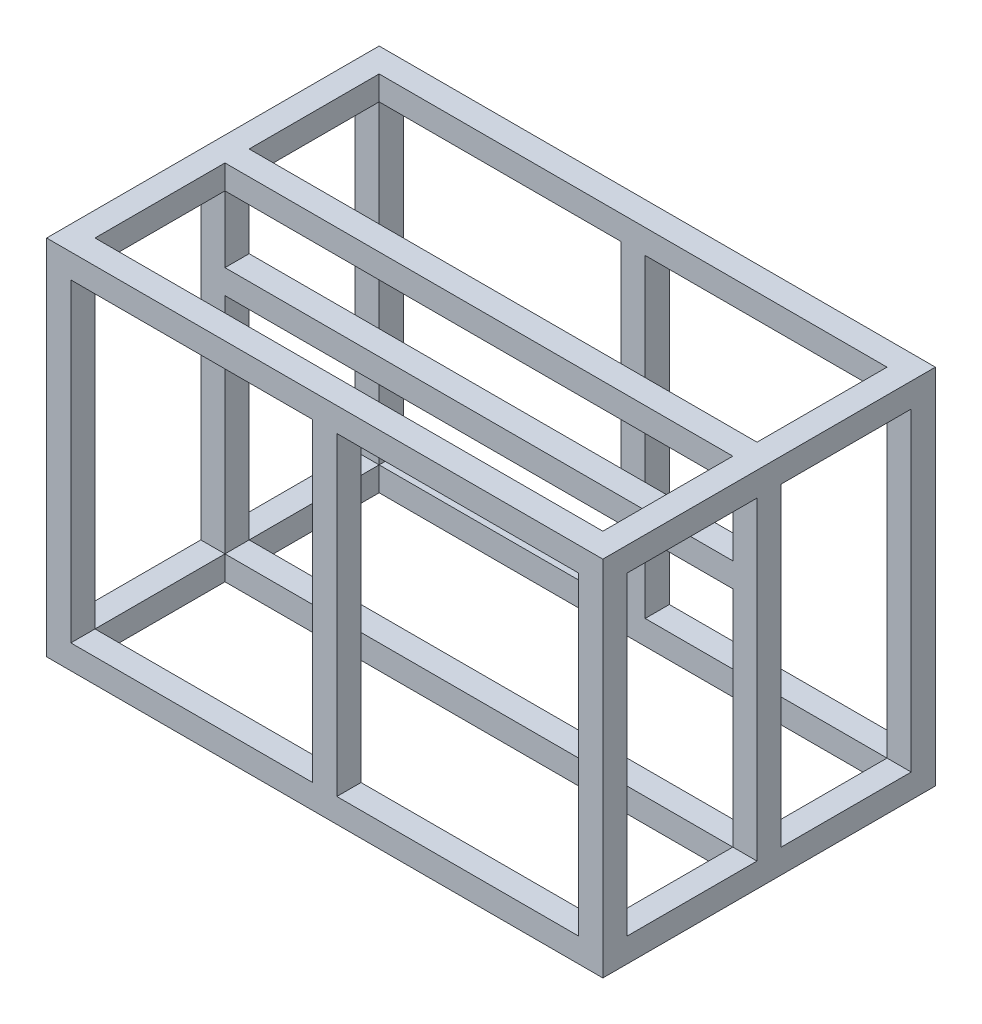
from build123d import *

# Parameters (mm, degrees)
SKETCH_1_W           = 400
SKETCH_1_H           = 370
SKETCH_1_H_2         = 110
EXTRUDE_1_DEPTH      = 550
SKETCH_2_OUTSIDE_W   = 1167.674
SKETCH_2_OUTSIDE_H   = 797.674
SKETCH_2_OUTSIDE_W_2 = 840
SKETCH_2_OUTSIDE_H_2 = 215
CUT_EXTRUDE_1_DEPTH  = 1229.372907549
SKETCH_3_W           = 215
SKETCH_3_H           = 520
CUT_EXTRUDE_2_DEPTH  = 1229.372907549
CUT_EXTRUDE_3_REACH  = 1230.373
SKETCH_4_W           = 400
SKETCH_4_H           = 40
CUT_EXTRUDE_4_REACH  = 1230.373
SKETCH_5_W           = 400
SKETCH_5_H           = 40
CUT_EXTRUDE_5_REACH  = 1139.288
SKETCH_6_W           = 40
SKETCH_6_H           = 370
CUT_EXTRUDE_6_REACH  = 1139.288
SKETCH_7_W           = 40
SKETCH_7_H           = 110


with BuildPart() as part:
    # Sketch 1 → Extrude 1 (new body)
    with BuildSketch(Plane.XY):
        Polygon((0, 0), (0, 600), (40, 600), (880, 600), (920, 600), (920, 0), (880, 0), (40, 0), align=None)
        with Locations((240, 225)):
            Rectangle(SKETCH_1_W, SKETCH_1_H, mode=Mode.SUBTRACT)
        with Locations((680, 225)):
            Rectangle(SKETCH_1_W, SKETCH_1_H, mode=Mode.SUBTRACT)
        with Locations((240, 505)):
            Rectangle(SKETCH_1_W, SKETCH_1_H_2, mode=Mode.SUBTRACT)
        with Locations((680, 505)):
            Rectangle(SKETCH_1_W, SKETCH_1_H_2, mode=Mode.SUBTRACT)
    extrude(amount=EXTRUDE_1_DEPTH)

    # Sketch 2 outside → Cut-Extrude 1 (cut, through all)
    # profile 1 of 3: a face of its own
    with BuildSketch(Plane(origin=(0, 600, 0), x_dir=(1, 0, 0), z_dir=(0, 1, 0))):
        with Locations((460, -275)):
            Rectangle(SKETCH_2_OUTSIDE_W, SKETCH_2_OUTSIDE_H)
        Polygon((0, -550), (40, -550), (880, -550), (920, -550), (920, -510), (920, -40), (920, 0), (880, 0), (40, 0), (0, 0), (0, -40), (0, -510), align=None, mode=Mode.SUBTRACT)
    # profile 2 of 3: a face of its own
    with BuildSketch(Plane(origin=(0, 600, 0), x_dir=(1, 0, 0), z_dir=(0, 1, 0))):
        with Locations((460, -147.5)):
            Rectangle(SKETCH_2_OUTSIDE_W_2, SKETCH_2_OUTSIDE_H_2)
    # profile 3 of 3: a face of its own
    with BuildSketch(Plane(origin=(0, 600, 0), x_dir=(1, 0, 0), z_dir=(0, 1, 0))):
        with Locations((460, -402.5)):
            Rectangle(SKETCH_2_OUTSIDE_W_2, SKETCH_2_OUTSIDE_H_2)
    extrude(amount=-CUT_EXTRUDE_1_DEPTH, mode=Mode.SUBTRACT)

    # Sketch 3 → Cut-Extrude 2 (cut, through all)
    with BuildSketch(Plane(origin=(920, 0, 0), x_dir=(0, 0, -1), z_dir=(1, 0, 0))):
        with Locations((-402.5, 300)):
            Rectangle(SKETCH_3_W, SKETCH_3_H)
        with Locations((-147.5, 300)):
            Rectangle(SKETCH_3_W, SKETCH_3_H)
    extrude(amount=-CUT_EXTRUDE_2_DEPTH, mode=Mode.SUBTRACT)

    # Sketch 4 → Cut-Extrude 3 (cut, up to next)
    with BuildSketch(Plane.XY.offset(550), mode=Mode.PRIVATE) as cut_extrude_3_sk1:
        with Locations((240, 430)):
            Rectangle(SKETCH_4_W, SKETCH_4_H)
    cut_extrude_3_tool1 = extrude(cut_extrude_3_sk1.sketch, amount=-CUT_EXTRUDE_3_REACH, mode=Mode.PRIVATE) & part.part
    # Sketch 4 → Cut-Extrude 3 (cut, up to next)
    with BuildSketch(Plane.XY.offset(550), mode=Mode.PRIVATE) as cut_extrude_3_sk2:
        with Locations((680, 430)):
            Rectangle(SKETCH_4_W, SKETCH_4_H)
    cut_extrude_3_tool2 = extrude(cut_extrude_3_sk2.sketch, amount=-CUT_EXTRUDE_3_REACH, mode=Mode.PRIVATE) & part.part
    add(cut_extrude_3_tool1.solids().sort_by_distance((240, 430, 550))[0], mode=Mode.SUBTRACT)
    add(cut_extrude_3_tool2.solids().sort_by_distance((680, 430, 550))[0], mode=Mode.SUBTRACT)

    # Sketch 5 → Cut-Extrude 4 (cut, up to next)
    with BuildSketch(Plane(origin=(0, 0, 0), x_dir=(-1, 0, 0), z_dir=(0, 0, -1)), mode=Mode.PRIVATE) as cut_extrude_4_sk1:
        with Locations((-680, 430)):
            Rectangle(SKETCH_5_W, SKETCH_5_H)
    cut_extrude_4_tool1 = extrude(cut_extrude_4_sk1.sketch, amount=-CUT_EXTRUDE_4_REACH, mode=Mode.PRIVATE) & part.part
    # Sketch 5 → Cut-Extrude 4 (cut, up to next)
    with BuildSketch(Plane(origin=(0, 0, 0), x_dir=(-1, 0, 0), z_dir=(0, 0, -1)), mode=Mode.PRIVATE) as cut_extrude_4_sk2:
        with Locations((-240, 430)):
            Rectangle(SKETCH_5_W, SKETCH_5_H)
    cut_extrude_4_tool2 = extrude(cut_extrude_4_sk2.sketch, amount=-CUT_EXTRUDE_4_REACH, mode=Mode.PRIVATE) & part.part
    add(cut_extrude_4_tool1.solids().sort_by_distance((680, 430, 0))[0], mode=Mode.SUBTRACT)
    add(cut_extrude_4_tool2.solids().sort_by_distance((240, 430, 0))[0], mode=Mode.SUBTRACT)

    # Sketch 6 → Cut-Extrude 5 (cut, up to next)
    with BuildSketch(Plane(origin=(0, 0, 255), x_dir=(-1, 0, 0), z_dir=(0, 0, -1)), mode=Mode.PRIVATE) as cut_extrude_5_sk1:
        with Locations((-460, 225)):
            Rectangle(SKETCH_6_W, SKETCH_6_H)
    cut_extrude_5_tool1 = extrude(cut_extrude_5_sk1.sketch, amount=-CUT_EXTRUDE_5_REACH, mode=Mode.PRIVATE) & part.part
    add(cut_extrude_5_tool1.solids().sort_by_distance((460, 225, 255))[0], mode=Mode.SUBTRACT)

    # Sketch 7 → Cut-Extrude 6 (cut, up to next)
    with BuildSketch(Plane(origin=(0, 0, 255), x_dir=(-1, 0, 0), z_dir=(0, 0, -1)), mode=Mode.PRIVATE) as cut_extrude_6_sk1:
        with Locations((-460, 505)):
            Rectangle(SKETCH_7_W, SKETCH_7_H)
    cut_extrude_6_tool1 = extrude(cut_extrude_6_sk1.sketch, amount=-CUT_EXTRUDE_6_REACH, mode=Mode.PRIVATE) & part.part
    add(cut_extrude_6_tool1.solids().sort_by_distance((460, 505, 255))[0], mode=Mode.SUBTRACT)


solid = part.part
